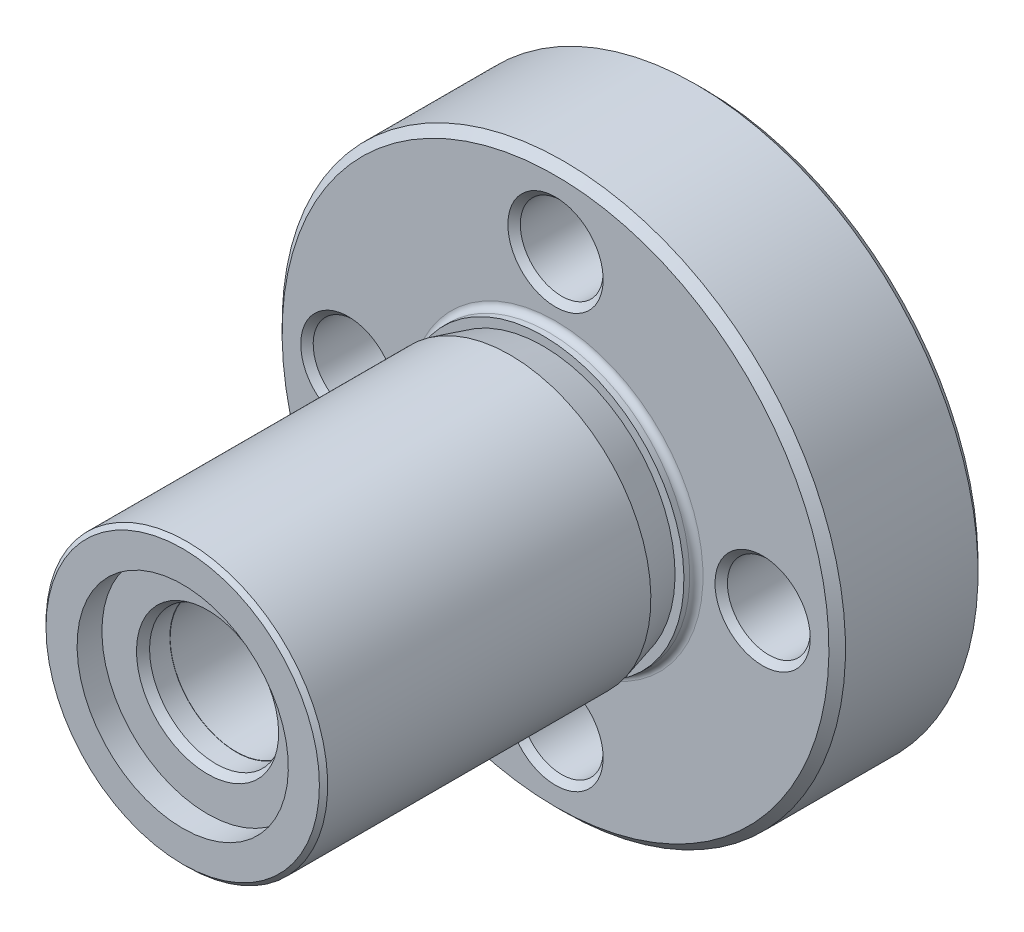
ISO-10303-21;
HEADER;
FILE_DESCRIPTION(('STEP AP214'),'2;1');
FILE_NAME('part.step','',(''),(''),'','','');
FILE_SCHEMA(('AUTOMOTIVE_DESIGN { 1 0 10303 214 1 1 1 1 }'));
ENDSEC;
DATA;
#1=APPLICATION_CONTEXT('core data for automotive mechanical design processes');
#2=APPLICATION_PROTOCOL_DEFINITION('international standard','automotive_design',2000,#1);
#3=PRODUCT_CONTEXT('',#1,'mechanical');
#4=PRODUCT('Part','Part','',(#3));
#5=PRODUCT_RELATED_PRODUCT_CATEGORY('part','',(#4));
#6=PRODUCT_DEFINITION_FORMATION('','',#4);
#7=PRODUCT_DEFINITION_CONTEXT('part definition',#1,'design');
#8=PRODUCT_DEFINITION('design','',#6,#7);
#9=PRODUCT_DEFINITION_SHAPE('','',#8);
#10=(LENGTH_UNIT() NAMED_UNIT(*) SI_UNIT(.MILLI.,.METRE.));
#11=(NAMED_UNIT(*) PLANE_ANGLE_UNIT() SI_UNIT($,.RADIAN.));
#12=(NAMED_UNIT(*) SI_UNIT($,.STERADIAN.) SOLID_ANGLE_UNIT());
#13=UNCERTAINTY_MEASURE_WITH_UNIT(LENGTH_MEASURE(1.E-05),#10,'distance_accuracy_value','');
#14=(GEOMETRIC_REPRESENTATION_CONTEXT(3) GLOBAL_UNCERTAINTY_ASSIGNED_CONTEXT((#13)) GLOBAL_UNIT_ASSIGNED_CONTEXT((#10,
#11,#12)) REPRESENTATION_CONTEXT('',''));
#15=CARTESIAN_POINT('',(0.,0.,0.));
#16=DIRECTION('',(0.,0.,1.));
#17=DIRECTION('',(1.,0.,0.));
#18=AXIS2_PLACEMENT_3D('',#15,#16,#17);
#19=CARTESIAN_POINT('',(0.,0.,0.));
#20=DIRECTION('',(0.,0.,-1.));
#21=DIRECTION('',(0.,1.,0.));
#22=AXIS2_PLACEMENT_3D('',#19,#20,#21);
#23=CYLINDRICAL_SURFACE('',#22,8.);
#24=CARTESIAN_POINT('',(0.,0.,1.));
#25=DIRECTION('',(0.,0.,-1.));
#26=DIRECTION('',(0.,1.,0.));
#27=AXIS2_PLACEMENT_3D('',#24,#25,#26);
#28=CIRCLE('',#27,8.);
#29=CARTESIAN_POINT('',(0.,8.,1.));
#30=VERTEX_POINT('',#29);
#31=EDGE_CURVE('E19',#30,#30,#28,.T.);
#32=ORIENTED_EDGE('',*,*,#31,.T.);
#33=EDGE_LOOP('',(#32));
#34=FACE_BOUND('',#33,.T.);
#35=CARTESIAN_POINT('',(0.,0.,19.5));
#36=DIRECTION('',(0.,0.,1.));
#37=DIRECTION('',(0.,-1.,0.));
#38=AXIS2_PLACEMENT_3D('',#35,#36,#37);
#39=CIRCLE('',#38,8.);
#40=CARTESIAN_POINT('',(0.,-8.,19.5));
#41=VERTEX_POINT('',#40);
#42=EDGE_CURVE('E60',#41,#41,#39,.T.);
#43=ORIENTED_EDGE('',*,*,#42,.T.);
#44=EDGE_LOOP('',(#43));
#45=FACE_BOUND('',#44,.T.);
#46=ADVANCED_FACE('F12',(#34,#45),#23,.F.);
#47=CARTESIAN_POINT('',(0.,0.,0.));
#48=DIRECTION('',(0.,0.,-1.));
#49=DIRECTION('',(0.,1.,0.));
#50=AXIS2_PLACEMENT_3D('',#47,#48,#49);
#51=CYLINDRICAL_SURFACE('',#50,17.);
#52=CARTESIAN_POINT('',(0.,0.,18.8));
#53=DIRECTION('',(0.,0.,1.));
#54=DIRECTION('',(0.,-1.,0.));
#55=AXIS2_PLACEMENT_3D('',#52,#53,#54);
#56=CIRCLE('',#55,17.);
#57=CARTESIAN_POINT('',(0.,-17.,18.8));
#58=VERTEX_POINT('',#57);
#59=EDGE_CURVE('E111',#58,#58,#56,.T.);
#60=ORIENTED_EDGE('',*,*,#59,.T.);
#61=EDGE_LOOP('',(#60));
#62=FACE_BOUND('',#61,.T.);
#63=CARTESIAN_POINT('',(0.,0.,19.5));
#64=DIRECTION('',(0.,0.,-1.));
#65=DIRECTION('',(0.,1.,0.));
#66=AXIS2_PLACEMENT_3D('',#63,#64,#65);
#67=CIRCLE('',#66,17.);
#68=CARTESIAN_POINT('',(0.,17.,19.5));
#69=VERTEX_POINT('',#68);
#70=EDGE_CURVE('E87',#69,#69,#67,.T.);
#71=ORIENTED_EDGE('',*,*,#70,.T.);
#72=EDGE_LOOP('',(#71));
#73=FACE_BOUND('',#72,.T.);
#74=ADVANCED_FACE('F155',(#62,#73),#51,.T.);
#75=CARTESIAN_POINT('',(8.,0.,0.));
#76=DIRECTION('',(0.,0.,-1.));
#77=DIRECTION('',(0.,1.,0.));
#78=AXIS2_PLACEMENT_3D('',#75,#76,#77);
#79=PLANE('',#78);
#80=CARTESIAN_POINT('',(0.,0.,0.));
#81=DIRECTION('',(0.,0.,-1.));
#82=DIRECTION('',(0.,1.,0.));
#83=AXIS2_PLACEMENT_3D('',#80,#81,#82);
#84=CIRCLE('',#83,8.57735026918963);
#85=CARTESIAN_POINT('',(0.,8.57735026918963,0.));
#86=VERTEX_POINT('',#85);
#87=EDGE_CURVE('E8',#86,#86,#84,.F.);
#88=ORIENTED_EDGE('',*,*,#87,.T.);
#89=EDGE_LOOP('',(#88));
#90=FACE_BOUND('',#89,.T.);
#91=CARTESIAN_POINT('',(0.,0.,0.));
#92=DIRECTION('',(0.,0.,-1.));
#93=DIRECTION('',(0.,1.,0.));
#94=AXIS2_PLACEMENT_3D('',#91,#92,#93);
#95=CIRCLE('',#94,33.);
#96=CARTESIAN_POINT('',(0.,33.,0.));
#97=VERTEX_POINT('',#96);
#98=EDGE_CURVE('E99',#97,#97,#95,.T.);
#99=ORIENTED_EDGE('',*,*,#98,.T.);
#100=EDGE_LOOP('',(#99));
#101=FACE_BOUND('',#100,.T.);
#102=CARTESIAN_POINT('',(25.,0.,0.));
#103=DIRECTION('',(0.,0.,-1.));
#104=DIRECTION('',(0.,1.,0.));
#105=AXIS2_PLACEMENT_3D('',#102,#103,#104);
#106=CIRCLE('',#105,5.75);
#107=CARTESIAN_POINT('',(25.,5.75,0.));
#108=VERTEX_POINT('',#107);
#109=EDGE_CURVE('E72',#108,#108,#106,.T.);
#110=ORIENTED_EDGE('',*,*,#109,.F.);
#111=EDGE_LOOP('',(#110));
#112=FACE_BOUND('',#111,.T.);
#113=CARTESIAN_POINT('',(0.,-25.,0.));
#114=DIRECTION('',(0.,0.,-1.));
#115=DIRECTION('',(0.,1.,0.));
#116=AXIS2_PLACEMENT_3D('',#113,#114,#115);
#117=CIRCLE('',#116,5.75);
#118=CARTESIAN_POINT('',(0.,-19.25,0.));
#119=VERTEX_POINT('',#118);
#120=EDGE_CURVE('E75',#119,#119,#117,.T.);
#121=ORIENTED_EDGE('',*,*,#120,.F.);
#122=EDGE_LOOP('',(#121));
#123=FACE_BOUND('',#122,.T.);
#124=CARTESIAN_POINT('',(-25.,0.,0.));
#125=DIRECTION('',(0.,0.,-1.));
#126=DIRECTION('',(0.,1.,0.));
#127=AXIS2_PLACEMENT_3D('',#124,#125,#126);
#128=CIRCLE('',#127,5.75);
#129=CARTESIAN_POINT('',(-25.,5.75,0.));
#130=VERTEX_POINT('',#129);
#131=EDGE_CURVE('E78',#130,#130,#128,.T.);
#132=ORIENTED_EDGE('',*,*,#131,.F.);
#133=EDGE_LOOP('',(#132));
#134=FACE_BOUND('',#133,.T.);
#135=CARTESIAN_POINT('',(0.,25.,0.));
#136=DIRECTION('',(0.,0.,-1.));
#137=DIRECTION('',(0.,1.,0.));
#138=AXIS2_PLACEMENT_3D('',#135,#136,#137);
#139=CIRCLE('',#138,5.75);
#140=CARTESIAN_POINT('',(0.,30.75,0.));
#141=VERTEX_POINT('',#140);
#142=EDGE_CURVE('E81',#141,#141,#139,.T.);
#143=ORIENTED_EDGE('',*,*,#142,.F.);
#144=EDGE_LOOP('',(#143));
#145=FACE_BOUND('',#144,.T.);
#146=ADVANCED_FACE('F162',(#90,#101,#112,#123,#134,#145),#79,.T.);
#147=CARTESIAN_POINT('',(0.,0.,0.));
#148=DIRECTION('',(0.,0.,-1.));
#149=DIRECTION('',(0.,1.,0.));
#150=AXIS2_PLACEMENT_3D('',#147,#148,#149);
#151=CYLINDRICAL_SURFACE('',#150,34.);
#152=CARTESIAN_POINT('',(0.,0.,17.));
#153=DIRECTION('',(0.,0.,1.));
#154=DIRECTION('',(0.,-1.,0.));
#155=AXIS2_PLACEMENT_3D('',#152,#153,#154);
#156=CIRCLE('',#155,34.);
#157=CARTESIAN_POINT('',(0.,-34.,17.));
#158=VERTEX_POINT('',#157);
#159=EDGE_CURVE('E93',#158,#158,#156,.F.);
#160=ORIENTED_EDGE('',*,*,#159,.T.);
#161=EDGE_LOOP('',(#160));
#162=FACE_BOUND('',#161,.T.);
#163=CARTESIAN_POINT('',(0.,0.,1.));
#164=DIRECTION('',(0.,0.,-1.));
#165=DIRECTION('',(0.,1.,0.));
#166=AXIS2_PLACEMENT_3D('',#163,#164,#165);
#167=CIRCLE('',#166,34.);
#168=CARTESIAN_POINT('',(0.,34.,1.));
#169=VERTEX_POINT('',#168);
#170=EDGE_CURVE('E90',#169,#169,#167,.F.);
#171=ORIENTED_EDGE('',*,*,#170,.T.);
#172=EDGE_LOOP('',(#171));
#173=FACE_BOUND('',#172,.T.);
#174=ADVANCED_FACE('F231',(#162,#173),#151,.T.);
#175=CARTESIAN_POINT('',(17.,0.,18.));
#176=DIRECTION('',(0.,0.,1.));
#177=DIRECTION('',(0.,-1.,0.));
#178=AXIS2_PLACEMENT_3D('',#175,#176,#177);
#179=PLANE('',#178);
#180=CARTESIAN_POINT('',(25.,0.,18.));
#181=DIRECTION('',(0.,0.,1.));
#182=DIRECTION('',(0.,-1.,0.));
#183=AXIS2_PLACEMENT_3D('',#180,#181,#182);
#184=CIRCLE('',#183,5.75);
#185=CARTESIAN_POINT('',(25.,-5.75,18.));
#186=VERTEX_POINT('',#185);
#187=EDGE_CURVE('E24',#186,#186,#184,.F.);
#188=ORIENTED_EDGE('',*,*,#187,.T.);
#189=EDGE_LOOP('',(#188));
#190=FACE_BOUND('',#189,.T.);
#191=CARTESIAN_POINT('',(0.,25.,18.));
#192=DIRECTION('',(0.,0.,1.));
#193=DIRECTION('',(0.,-1.,0.));
#194=AXIS2_PLACEMENT_3D('',#191,#192,#193);
#195=CIRCLE('',#194,5.75);
#196=CARTESIAN_POINT('',(0.,19.25,18.));
#197=VERTEX_POINT('',#196);
#198=EDGE_CURVE('E126',#197,#197,#195,.F.);
#199=ORIENTED_EDGE('',*,*,#198,.T.);
#200=EDGE_LOOP('',(#199));
#201=FACE_BOUND('',#200,.T.);
#202=CARTESIAN_POINT('',(-25.,0.,18.));
#203=DIRECTION('',(0.,0.,1.));
#204=DIRECTION('',(0.,-1.,0.));
#205=AXIS2_PLACEMENT_3D('',#202,#203,#204);
#206=CIRCLE('',#205,5.75);
#207=CARTESIAN_POINT('',(-25.,-5.75,18.));
#208=VERTEX_POINT('',#207);
#209=EDGE_CURVE('E123',#208,#208,#206,.F.);
#210=ORIENTED_EDGE('',*,*,#209,.T.);
#211=EDGE_LOOP('',(#210));
#212=FACE_BOUND('',#211,.T.);
#213=CARTESIAN_POINT('',(0.,-25.,18.));
#214=DIRECTION('',(0.,0.,1.));
#215=DIRECTION('',(0.,-1.,0.));
#216=AXIS2_PLACEMENT_3D('',#213,#214,#215);
#217=CIRCLE('',#216,5.75);
#218=CARTESIAN_POINT('',(0.,-30.75,18.));
#219=VERTEX_POINT('',#218);
#220=EDGE_CURVE('E120',#219,#219,#217,.F.);
#221=ORIENTED_EDGE('',*,*,#220,.T.);
#222=EDGE_LOOP('',(#221));
#223=FACE_BOUND('',#222,.T.);
#224=CARTESIAN_POINT('',(0.,0.,18.));
#225=DIRECTION('',(0.,0.,1.));
#226=DIRECTION('',(0.,-1.,0.));
#227=AXIS2_PLACEMENT_3D('',#224,#225,#226);
#228=CIRCLE('',#227,17.8);
#229=CARTESIAN_POINT('',(0.,-17.8,18.));
#230=VERTEX_POINT('',#229);
#231=EDGE_CURVE('E108',#230,#230,#228,.F.);
#232=ORIENTED_EDGE('',*,*,#231,.T.);
#233=EDGE_LOOP('',(#232));
#234=FACE_BOUND('',#233,.T.);
#235=CARTESIAN_POINT('',(0.,0.,18.));
#236=DIRECTION('',(0.,0.,1.));
#237=DIRECTION('',(0.,-1.,0.));
#238=AXIS2_PLACEMENT_3D('',#235,#236,#237);
#239=CIRCLE('',#238,33.);
#240=CARTESIAN_POINT('',(0.,-33.,18.));
#241=VERTEX_POINT('',#240);
#242=EDGE_CURVE('E96',#241,#241,#239,.T.);
#243=ORIENTED_EDGE('',*,*,#242,.T.);
#244=EDGE_LOOP('',(#243));
#245=FACE_BOUND('',#244,.T.);
#246=ADVANCED_FACE('F131',(#190,#201,#212,#223,#234,#245),#179,.T.);
#247=CARTESIAN_POINT('',(-17.,0.,19.5));
#248=DIRECTION('',(0.,0.,1.));
#249=DIRECTION('',(0.,-1.,0.));
#250=AXIS2_PLACEMENT_3D('',#247,#248,#249);
#251=PLANE('',#250);
#252=CARTESIAN_POINT('',(0.,0.,19.5));
#253=DIRECTION('',(0.,0.,-1.));
#254=DIRECTION('',(0.,1.,0.));
#255=AXIS2_PLACEMENT_3D('',#252,#253,#254);
#256=CIRCLE('',#255,15.9282032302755);
#257=CARTESIAN_POINT('',(0.,15.9282032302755,19.5));
#258=VERTEX_POINT('',#257);
#259=EDGE_CURVE('E84',#258,#258,#256,.T.);
#260=ORIENTED_EDGE('',*,*,#259,.T.);
#261=EDGE_LOOP('',(#260));
#262=FACE_BOUND('',#261,.T.);
#263=ORIENTED_EDGE('',*,*,#70,.F.);
#264=EDGE_LOOP('',(#263));
#265=FACE_BOUND('',#264,.T.);
#266=ADVANCED_FACE('F230',(#262,#265),#251,.T.);
#267=CARTESIAN_POINT('',(0.,25.,0.));
#268=DIRECTION('',(0.,0.,-1.));
#269=DIRECTION('',(0.,1.,0.));
#270=AXIS2_PLACEMENT_3D('',#267,#268,#269);
#271=CONICAL_SURFACE('',#270,5.75,0.785398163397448);
#272=CARTESIAN_POINT('',(0.,25.,0.75));
#273=DIRECTION('',(0.,0.,-1.));
#274=DIRECTION('',(0.,1.,0.));
#275=AXIS2_PLACEMENT_3D('',#272,#273,#274);
#276=CIRCLE('',#275,5.);
#277=CARTESIAN_POINT('',(0.,30.,0.75));
#278=VERTEX_POINT('',#277);
#279=EDGE_CURVE('E37',#278,#278,#276,.F.);
#280=ORIENTED_EDGE('',*,*,#279,.T.);
#281=EDGE_LOOP('',(#280));
#282=FACE_BOUND('',#281,.T.);
#283=ORIENTED_EDGE('',*,*,#142,.T.);
#284=EDGE_LOOP('',(#283));
#285=FACE_BOUND('',#284,.T.);
#286=ADVANCED_FACE('F266',(#282,#285),#271,.F.);
#287=CARTESIAN_POINT('',(-25.,0.,0.));
#288=DIRECTION('',(0.,0.,-1.));
#289=DIRECTION('',(0.,1.,0.));
#290=AXIS2_PLACEMENT_3D('',#287,#288,#289);
#291=CONICAL_SURFACE('',#290,5.75,0.785398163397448);
#292=CARTESIAN_POINT('',(-25.,0.,0.75));
#293=DIRECTION('',(0.,0.,-1.));
#294=DIRECTION('',(0.,1.,0.));
#295=AXIS2_PLACEMENT_3D('',#292,#293,#294);
#296=CIRCLE('',#295,5.);
#297=CARTESIAN_POINT('',(-25.,5.,0.75));
#298=VERTEX_POINT('',#297);
#299=EDGE_CURVE('E34',#298,#298,#296,.F.);
#300=ORIENTED_EDGE('',*,*,#299,.T.);
#301=EDGE_LOOP('',(#300));
#302=FACE_BOUND('',#301,.T.);
#303=ORIENTED_EDGE('',*,*,#131,.T.);
#304=EDGE_LOOP('',(#303));
#305=FACE_BOUND('',#304,.T.);
#306=ADVANCED_FACE('F268',(#302,#305),#291,.F.);
#307=CARTESIAN_POINT('',(0.,-25.,0.));
#308=DIRECTION('',(0.,0.,-1.));
#309=DIRECTION('',(0.,1.,0.));
#310=AXIS2_PLACEMENT_3D('',#307,#308,#309);
#311=CONICAL_SURFACE('',#310,5.75,0.785398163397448);
#312=CARTESIAN_POINT('',(0.,-25.,0.75));
#313=DIRECTION('',(0.,0.,-1.));
#314=DIRECTION('',(0.,1.,0.));
#315=AXIS2_PLACEMENT_3D('',#312,#313,#314);
#316=CIRCLE('',#315,5.);
#317=CARTESIAN_POINT('',(0.,-20.,0.75));
#318=VERTEX_POINT('',#317);
#319=EDGE_CURVE('E31',#318,#318,#316,.F.);
#320=ORIENTED_EDGE('',*,*,#319,.T.);
#321=EDGE_LOOP('',(#320));
#322=FACE_BOUND('',#321,.T.);
#323=ORIENTED_EDGE('',*,*,#120,.T.);
#324=EDGE_LOOP('',(#323));
#325=FACE_BOUND('',#324,.T.);
#326=ADVANCED_FACE('F276',(#322,#325),#311,.F.);
#327=CARTESIAN_POINT('',(25.,0.,0.));
#328=DIRECTION('',(0.,0.,-1.));
#329=DIRECTION('',(0.,1.,0.));
#330=AXIS2_PLACEMENT_3D('',#327,#328,#329);
#331=CONICAL_SURFACE('',#330,5.75,0.785398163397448);
#332=CARTESIAN_POINT('',(25.,0.,0.75));
#333=DIRECTION('',(0.,0.,-1.));
#334=DIRECTION('',(0.,1.,0.));
#335=AXIS2_PLACEMENT_3D('',#332,#333,#334);
#336=CIRCLE('',#335,5.);
#337=CARTESIAN_POINT('',(25.,5.,0.75));
#338=VERTEX_POINT('',#337);
#339=EDGE_CURVE('E48',#338,#338,#336,.F.);
#340=ORIENTED_EDGE('',*,*,#339,.T.);
#341=EDGE_LOOP('',(#340));
#342=FACE_BOUND('',#341,.T.);
#343=ORIENTED_EDGE('',*,*,#109,.T.);
#344=EDGE_LOOP('',(#343));
#345=FACE_BOUND('',#344,.T.);
#346=ADVANCED_FACE('F242',(#342,#345),#331,.F.);
#347=CARTESIAN_POINT('',(0.,0.,17.));
#348=DIRECTION('',(0.,0.,-1.));
#349=DIRECTION('',(0.,1.,0.));
#350=AXIS2_PLACEMENT_3D('',#347,#348,#349);
#351=CONICAL_SURFACE('',#350,34.,0.785398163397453);
#352=ORIENTED_EDGE('',*,*,#242,.F.);
#353=EDGE_LOOP('',(#352));
#354=FACE_BOUND('',#353,.T.);
#355=ORIENTED_EDGE('',*,*,#159,.F.);
#356=EDGE_LOOP('',(#355));
#357=FACE_BOUND('',#356,.T.);
#358=ADVANCED_FACE('F239',(#354,#357),#351,.T.);
#359=CARTESIAN_POINT('',(0.,0.,0.));
#360=DIRECTION('',(0.,0.,1.));
#361=DIRECTION('',(0.,-1.,0.));
#362=AXIS2_PLACEMENT_3D('',#359,#360,#361);
#363=CONICAL_SURFACE('',#362,33.,0.785398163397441);
#364=ORIENTED_EDGE('',*,*,#170,.F.);
#365=EDGE_LOOP('',(#364));
#366=FACE_BOUND('',#365,.T.);
#367=ORIENTED_EDGE('',*,*,#98,.F.);
#368=EDGE_LOOP('',(#367));
#369=FACE_BOUND('',#368,.T.);
#370=ADVANCED_FACE('F149',(#366,#369),#363,.T.);
#371=CARTESIAN_POINT('',(0.,0.,18.8));
#372=DIRECTION('',(0.,0.,1.));
#373=DIRECTION('',(0.,-1.,0.));
#374=AXIS2_PLACEMENT_3D('',#371,#372,#373);
#375=TOROIDAL_SURFACE('',#374,17.8,0.8);
#376=ORIENTED_EDGE('',*,*,#59,.F.);
#377=EDGE_LOOP('',(#376));
#378=FACE_BOUND('',#377,.T.);
#379=ORIENTED_EDGE('',*,*,#231,.F.);
#380=EDGE_LOOP('',(#379));
#381=FACE_BOUND('',#380,.T.);
#382=ADVANCED_FACE('F137',(#378,#381),#375,.F.);
#383=CARTESIAN_POINT('',(25.,0.,16.5));
#384=DIRECTION('',(0.,0.,1.));
#385=DIRECTION('',(0.,-1.,0.));
#386=AXIS2_PLACEMENT_3D('',#383,#384,#385);
#387=CONICAL_SURFACE('',#386,4.25,0.78539816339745);
#388=CARTESIAN_POINT('',(25.,0.,17.25));
#389=DIRECTION('',(0.,0.,1.));
#390=DIRECTION('',(0.,-1.,0.));
#391=AXIS2_PLACEMENT_3D('',#388,#389,#390);
#392=CIRCLE('',#391,5.);
#393=CARTESIAN_POINT('',(25.,-5.,17.25));
#394=VERTEX_POINT('',#393);
#395=EDGE_CURVE('E15',#394,#394,#392,.T.);
#396=ORIENTED_EDGE('',*,*,#395,.F.);
#397=EDGE_LOOP('',(#396));
#398=FACE_BOUND('',#397,.T.);
#399=ORIENTED_EDGE('',*,*,#187,.F.);
#400=EDGE_LOOP('',(#399));
#401=FACE_BOUND('',#400,.T.);
#402=ADVANCED_FACE('F134',(#398,#401),#387,.F.);
#403=CARTESIAN_POINT('',(0.,25.,16.5));
#404=DIRECTION('',(0.,0.,1.));
#405=DIRECTION('',(0.,-1.,0.));
#406=AXIS2_PLACEMENT_3D('',#403,#404,#405);
#407=CONICAL_SURFACE('',#406,4.25,0.78539816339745);
#408=CARTESIAN_POINT('',(0.,25.,17.25));
#409=DIRECTION('',(0.,0.,1.));
#410=DIRECTION('',(0.,-1.,0.));
#411=AXIS2_PLACEMENT_3D('',#408,#409,#410);
#412=CIRCLE('',#411,5.);
#413=CARTESIAN_POINT('',(0.,20.,17.25));
#414=VERTEX_POINT('',#413);
#415=EDGE_CURVE('E35',#414,#414,#412,.T.);
#416=ORIENTED_EDGE('',*,*,#415,.F.);
#417=EDGE_LOOP('',(#416));
#418=FACE_BOUND('',#417,.T.);
#419=ORIENTED_EDGE('',*,*,#198,.F.);
#420=EDGE_LOOP('',(#419));
#421=FACE_BOUND('',#420,.T.);
#422=ADVANCED_FACE('F136',(#418,#421),#407,.F.);
#423=CARTESIAN_POINT('',(-25.,0.,16.5));
#424=DIRECTION('',(0.,0.,1.));
#425=DIRECTION('',(0.,-1.,0.));
#426=AXIS2_PLACEMENT_3D('',#423,#424,#425);
#427=CONICAL_SURFACE('',#426,4.25,0.78539816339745);
#428=CARTESIAN_POINT('',(-25.,0.,17.25));
#429=DIRECTION('',(0.,0.,1.));
#430=DIRECTION('',(0.,-1.,0.));
#431=AXIS2_PLACEMENT_3D('',#428,#429,#430);
#432=CIRCLE('',#431,5.);
#433=CARTESIAN_POINT('',(-25.,-5.,17.25));
#434=VERTEX_POINT('',#433);
#435=EDGE_CURVE('E32',#434,#434,#432,.T.);
#436=ORIENTED_EDGE('',*,*,#435,.F.);
#437=EDGE_LOOP('',(#436));
#438=FACE_BOUND('',#437,.T.);
#439=ORIENTED_EDGE('',*,*,#209,.F.);
#440=EDGE_LOOP('',(#439));
#441=FACE_BOUND('',#440,.T.);
#442=ADVANCED_FACE('F146',(#438,#441),#427,.F.);
#443=CARTESIAN_POINT('',(0.,-25.,16.5));
#444=DIRECTION('',(0.,0.,1.));
#445=DIRECTION('',(0.,-1.,0.));
#446=AXIS2_PLACEMENT_3D('',#443,#444,#445);
#447=CONICAL_SURFACE('',#446,4.25,0.78539816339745);
#448=CARTESIAN_POINT('',(0.,-25.,17.25));
#449=DIRECTION('',(0.,0.,1.));
#450=DIRECTION('',(0.,-1.,0.));
#451=AXIS2_PLACEMENT_3D('',#448,#449,#450);
#452=CIRCLE('',#451,5.);
#453=CARTESIAN_POINT('',(0.,-30.,17.25));
#454=VERTEX_POINT('',#453);
#455=EDGE_CURVE('E28',#454,#454,#452,.T.);
#456=ORIENTED_EDGE('',*,*,#455,.F.);
#457=EDGE_LOOP('',(#456));
#458=FACE_BOUND('',#457,.T.);
#459=ORIENTED_EDGE('',*,*,#220,.F.);
#460=EDGE_LOOP('',(#459));
#461=FACE_BOUND('',#460,.T.);
#462=ADVANCED_FACE('F214',(#458,#461),#447,.F.);
#463=CARTESIAN_POINT('',(0.,0.,1.));
#464=DIRECTION('',(0.,0.,-1.));
#465=DIRECTION('',(0.,1.,0.));
#466=AXIS2_PLACEMENT_3D('',#463,#464,#465);
#467=CONICAL_SURFACE('',#466,8.,0.523598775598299);
#468=ORIENTED_EDGE('',*,*,#87,.F.);
#469=EDGE_LOOP('',(#468));
#470=FACE_BOUND('',#469,.T.);
#471=ORIENTED_EDGE('',*,*,#31,.F.);
#472=EDGE_LOOP('',(#471));
#473=FACE_BOUND('',#472,.T.);
#474=ADVANCED_FACE('F207',(#470,#473),#467,.F.);
#475=CARTESIAN_POINT('',(0.,0.,23.4898877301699));
#476=DIRECTION('',(0.,0.,1.));
#477=DIRECTION('',(0.,-1.,0.));
#478=AXIS2_PLACEMENT_3D('',#475,#476,#477);
#479=CONICAL_SURFACE('',#478,17.,0.262432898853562);
#480=ORIENTED_EDGE('',*,*,#259,.F.);
#481=EDGE_LOOP('',(#480));
#482=FACE_BOUND('',#481,.T.);
#483=CARTESIAN_POINT('',(0.,0.,23.4898877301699));
#484=DIRECTION('',(0.,0.,-1.));
#485=DIRECTION('',(0.,1.,0.));
#486=AXIS2_PLACEMENT_3D('',#483,#484,#485);
#487=CIRCLE('',#486,17.);
#488=CARTESIAN_POINT('',(0.,17.,23.4898877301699));
#489=VERTEX_POINT('',#488);
#490=EDGE_CURVE('E57',#489,#489,#487,.T.);
#491=ORIENTED_EDGE('',*,*,#490,.T.);
#492=EDGE_LOOP('',(#491));
#493=FACE_BOUND('',#492,.T.);
#494=ADVANCED_FACE('F200',(#482,#493),#479,.T.);
#495=CARTESIAN_POINT('',(0.,-15.9282032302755,19.5));
#496=DIRECTION('',(0.,0.,1.));
#497=DIRECTION('',(0.,-1.,0.));
#498=AXIS2_PLACEMENT_3D('',#495,#496,#497);
#499=PLANE('',#498);
#500=ORIENTED_EDGE('',*,*,#42,.F.);
#501=EDGE_LOOP('',(#500));
#502=FACE_BOUND('',#501,.T.);
#503=CARTESIAN_POINT('',(0.,0.,19.5));
#504=DIRECTION('',(0.,0.,-1.));
#505=DIRECTION('',(0.,1.,0.));
#506=AXIS2_PLACEMENT_3D('',#503,#504,#505);
#507=CIRCLE('',#506,7.96410161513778);
#508=CARTESIAN_POINT('',(0.,7.96410161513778,19.5));
#509=VERTEX_POINT('',#508);
#510=EDGE_CURVE('E54',#509,#509,#507,.T.);
#511=ORIENTED_EDGE('',*,*,#510,.F.);
#512=EDGE_LOOP('',(#511));
#513=FACE_BOUND('',#512,.T.);
#514=ADVANCED_FACE('F195',(#502,#513),#499,.F.);
#515=CARTESIAN_POINT('',(0.,0.,0.));
#516=DIRECTION('',(0.,0.,-1.));
#517=DIRECTION('',(0.,1.,0.));
#518=AXIS2_PLACEMENT_3D('',#515,#516,#517);
#519=CYLINDRICAL_SURFACE('',#518,7.96410161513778);
#520=CARTESIAN_POINT('',(0.,0.,56.5529288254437));
#521=DIRECTION('',(0.,0.,-1.));
#522=DIRECTION('',(0.,1.,0.));
#523=AXIS2_PLACEMENT_3D('',#520,#521,#522);
#524=CIRCLE('',#523,7.96410161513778);
#525=CARTESIAN_POINT('',(0.,7.96410161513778,56.5529288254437));
#526=VERTEX_POINT('',#525);
#527=EDGE_CURVE('E51',#526,#526,#524,.T.);
#528=ORIENTED_EDGE('',*,*,#527,.F.);
#529=EDGE_LOOP('',(#528));
#530=FACE_BOUND('',#529,.T.);
#531=ORIENTED_EDGE('',*,*,#510,.T.);
#532=EDGE_LOOP('',(#531));
#533=FACE_BOUND('',#532,.T.);
#534=ADVANCED_FACE('F189',(#530,#533),#519,.F.);
#535=CARTESIAN_POINT('',(0.,-7.96410161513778,56.5529288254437));
#536=DIRECTION('',(0.,0.,-1.));
#537=DIRECTION('',(0.,1.,0.));
#538=AXIS2_PLACEMENT_3D('',#535,#536,#537);
#539=PLANE('',#538);
#540=CARTESIAN_POINT('',(0.,0.,56.5529288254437));
#541=DIRECTION('',(0.,0.,-1.));
#542=DIRECTION('',(0.,1.,0.));
#543=AXIS2_PLACEMENT_3D('',#540,#541,#542);
#544=CIRCLE('',#543,8.);
#545=CARTESIAN_POINT('',(0.,8.,56.5529288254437));
#546=VERTEX_POINT('',#545);
#547=EDGE_CURVE('E63',#546,#546,#544,.T.);
#548=ORIENTED_EDGE('',*,*,#547,.F.);
#549=EDGE_LOOP('',(#548));
#550=FACE_BOUND('',#549,.T.);
#551=ORIENTED_EDGE('',*,*,#527,.T.);
#552=EDGE_LOOP('',(#551));
#553=FACE_BOUND('',#552,.T.);
#554=ADVANCED_FACE('F185',(#550,#553),#539,.F.);
#555=CARTESIAN_POINT('',(8.,0.,63.));
#556=DIRECTION('',(0.,0.,1.));
#557=DIRECTION('',(0.,-1.,0.));
#558=AXIS2_PLACEMENT_3D('',#555,#556,#557);
#559=PLANE('',#558);
#560=CARTESIAN_POINT('',(0.,0.,63.));
#561=DIRECTION('',(0.,0.,1.));
#562=DIRECTION('',(0.,-1.,0.));
#563=AXIS2_PLACEMENT_3D('',#560,#561,#562);
#564=CIRCLE('',#563,16.5);
#565=CARTESIAN_POINT('',(0.,-16.5,63.));
#566=VERTEX_POINT('',#565);
#567=EDGE_CURVE('E105',#566,#566,#564,.T.);
#568=ORIENTED_EDGE('',*,*,#567,.T.);
#569=EDGE_LOOP('',(#568));
#570=FACE_BOUND('',#569,.T.);
#571=CARTESIAN_POINT('',(0.,0.,63.));
#572=DIRECTION('',(0.,0.,1.));
#573=DIRECTION('',(0.,-1.,0.));
#574=AXIS2_PLACEMENT_3D('',#571,#572,#573);
#575=CIRCLE('',#574,12.75);
#576=CARTESIAN_POINT('',(0.,-12.75,63.));
#577=VERTEX_POINT('',#576);
#578=EDGE_CURVE('E66',#577,#577,#575,.T.);
#579=ORIENTED_EDGE('',*,*,#578,.F.);
#580=EDGE_LOOP('',(#579));
#581=FACE_BOUND('',#580,.T.);
#582=ADVANCED_FACE('F188',(#570,#581),#559,.T.);
#583=CARTESIAN_POINT('',(0.,0.,62.5));
#584=DIRECTION('',(0.,0.,-1.));
#585=DIRECTION('',(0.,1.,0.));
#586=AXIS2_PLACEMENT_3D('',#583,#584,#585);
#587=CONICAL_SURFACE('',#586,17.,0.785398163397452);
#588=ORIENTED_EDGE('',*,*,#567,.F.);
#589=EDGE_LOOP('',(#588));
#590=FACE_BOUND('',#589,.T.);
#591=CARTESIAN_POINT('',(0.,0.,62.5));
#592=DIRECTION('',(0.,0.,1.));
#593=DIRECTION('',(0.,-1.,0.));
#594=AXIS2_PLACEMENT_3D('',#591,#592,#593);
#595=CIRCLE('',#594,17.);
#596=CARTESIAN_POINT('',(0.,-17.,62.5));
#597=VERTEX_POINT('',#596);
#598=EDGE_CURVE('E102',#597,#597,#595,.F.);
#599=ORIENTED_EDGE('',*,*,#598,.F.);
#600=EDGE_LOOP('',(#599));
#601=FACE_BOUND('',#600,.T.);
#602=ADVANCED_FACE('F283',(#590,#601),#587,.T.);
#603=ORIENTED_EDGE('',*,*,#490,.F.);
#604=EDGE_LOOP('',(#603));
#605=FACE_BOUND('',#604,.T.);
#606=ORIENTED_EDGE('',*,*,#598,.T.);
#607=EDGE_LOOP('',(#606));
#608=FACE_BOUND('',#607,.T.);
#609=ADVANCED_FACE('F165',(#605,#608),#51,.T.);
#610=CARTESIAN_POINT('',(0.,0.,60.));
#611=DIRECTION('',(0.,0.,1.));
#612=DIRECTION('',(0.,-1.,0.));
#613=AXIS2_PLACEMENT_3D('',#610,#611,#612);
#614=CYLINDRICAL_SURFACE('',#613,12.75);
#615=CARTESIAN_POINT('',(0.,0.,60.));
#616=DIRECTION('',(0.,0.,1.));
#617=DIRECTION('',(0.,-1.,0.));
#618=AXIS2_PLACEMENT_3D('',#615,#616,#617);
#619=CIRCLE('',#618,12.75);
#620=CARTESIAN_POINT('',(0.,-12.75,60.));
#621=VERTEX_POINT('',#620);
#622=EDGE_CURVE('E69',#621,#621,#619,.T.);
#623=ORIENTED_EDGE('',*,*,#622,.F.);
#624=EDGE_LOOP('',(#623));
#625=FACE_BOUND('',#624,.T.);
#626=ORIENTED_EDGE('',*,*,#578,.T.);
#627=EDGE_LOOP('',(#626));
#628=FACE_BOUND('',#627,.T.);
#629=ADVANCED_FACE('F295',(#625,#628),#614,.F.);
#630=CARTESIAN_POINT('',(0.,0.,60.));
#631=DIRECTION('',(0.,0.,1.));
#632=DIRECTION('',(0.,-1.,0.));
#633=AXIS2_PLACEMENT_3D('',#630,#631,#632);
#634=PLANE('',#633);
#635=CARTESIAN_POINT('',(0.,0.,60.));
#636=DIRECTION('',(0.,0.,1.));
#637=DIRECTION('',(0.,-1.,0.));
#638=AXIS2_PLACEMENT_3D('',#635,#636,#637);
#639=CIRCLE('',#638,8.57735026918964);
#640=CARTESIAN_POINT('',(0.,-8.57735026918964,60.));
#641=VERTEX_POINT('',#640);
#642=EDGE_CURVE('E117',#641,#641,#639,.F.);
#643=ORIENTED_EDGE('',*,*,#642,.T.);
#644=EDGE_LOOP('',(#643));
#645=FACE_BOUND('',#644,.T.);
#646=ORIENTED_EDGE('',*,*,#622,.T.);
#647=EDGE_LOOP('',(#646));
#648=FACE_BOUND('',#647,.T.);
#649=ADVANCED_FACE('F179',(#645,#648),#634,.T.);
#650=CARTESIAN_POINT('',(0.,0.,59.));
#651=DIRECTION('',(0.,0.,1.));
#652=DIRECTION('',(0.,-1.,0.));
#653=AXIS2_PLACEMENT_3D('',#650,#651,#652);
#654=CONICAL_SURFACE('',#653,8.,0.523598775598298);
#655=ORIENTED_EDGE('',*,*,#642,.F.);
#656=EDGE_LOOP('',(#655));
#657=FACE_BOUND('',#656,.T.);
#658=CARTESIAN_POINT('',(0.,0.,59.));
#659=DIRECTION('',(0.,0.,1.));
#660=DIRECTION('',(0.,-1.,0.));
#661=AXIS2_PLACEMENT_3D('',#658,#659,#660);
#662=CIRCLE('',#661,8.);
#663=CARTESIAN_POINT('',(0.,-8.,59.));
#664=VERTEX_POINT('',#663);
#665=EDGE_CURVE('E114',#664,#664,#662,.T.);
#666=ORIENTED_EDGE('',*,*,#665,.F.);
#667=EDGE_LOOP('',(#666));
#668=FACE_BOUND('',#667,.T.);
#669=ADVANCED_FACE('F169',(#657,#668),#654,.F.);
#670=ORIENTED_EDGE('',*,*,#665,.T.);
#671=EDGE_LOOP('',(#670));
#672=FACE_BOUND('',#671,.T.);
#673=ORIENTED_EDGE('',*,*,#547,.T.);
#674=EDGE_LOOP('',(#673));
#675=FACE_BOUND('',#674,.T.);
#676=ADVANCED_FACE('F157',(#672,#675),#23,.F.);
#677=CARTESIAN_POINT('',(0.,-25.,0.));
#678=DIRECTION('',(0.,0.,1.));
#679=DIRECTION('',(0.,-1.,0.));
#680=AXIS2_PLACEMENT_3D('',#677,#678,#679);
#681=CYLINDRICAL_SURFACE('',#680,5.);
#682=ORIENTED_EDGE('',*,*,#455,.T.);
#683=EDGE_LOOP('',(#682));
#684=FACE_BOUND('',#683,.T.);
#685=ORIENTED_EDGE('',*,*,#319,.F.);
#686=EDGE_LOOP('',(#685));
#687=FACE_BOUND('',#686,.T.);
#688=ADVANCED_FACE('F168',(#684,#687),#681,.F.);
#689=CARTESIAN_POINT('',(-25.,0.,0.));
#690=DIRECTION('',(0.,0.,1.));
#691=DIRECTION('',(0.,-1.,0.));
#692=AXIS2_PLACEMENT_3D('',#689,#690,#691);
#693=CYLINDRICAL_SURFACE('',#692,5.);
#694=ORIENTED_EDGE('',*,*,#435,.T.);
#695=EDGE_LOOP('',(#694));
#696=FACE_BOUND('',#695,.T.);
#697=ORIENTED_EDGE('',*,*,#299,.F.);
#698=EDGE_LOOP('',(#697));
#699=FACE_BOUND('',#698,.T.);
#700=ADVANCED_FACE('F176',(#696,#699),#693,.F.);
#701=CARTESIAN_POINT('',(0.,25.,0.));
#702=DIRECTION('',(0.,0.,1.));
#703=DIRECTION('',(0.,-1.,0.));
#704=AXIS2_PLACEMENT_3D('',#701,#702,#703);
#705=CYLINDRICAL_SURFACE('',#704,5.);
#706=ORIENTED_EDGE('',*,*,#415,.T.);
#707=EDGE_LOOP('',(#706));
#708=FACE_BOUND('',#707,.T.);
#709=ORIENTED_EDGE('',*,*,#279,.F.);
#710=EDGE_LOOP('',(#709));
#711=FACE_BOUND('',#710,.T.);
#712=ADVANCED_FACE('F484',(#708,#711),#705,.F.);
#713=CARTESIAN_POINT('',(25.,0.,0.));
#714=DIRECTION('',(0.,0.,1.));
#715=DIRECTION('',(0.,-1.,0.));
#716=AXIS2_PLACEMENT_3D('',#713,#714,#715);
#717=CYLINDRICAL_SURFACE('',#716,5.);
#718=ORIENTED_EDGE('',*,*,#395,.T.);
#719=EDGE_LOOP('',(#718));
#720=FACE_BOUND('',#719,.T.);
#721=ORIENTED_EDGE('',*,*,#339,.F.);
#722=EDGE_LOOP('',(#721));
#723=FACE_BOUND('',#722,.T.);
#724=ADVANCED_FACE('F492',(#720,#723),#717,.F.);
#725=CLOSED_SHELL('',(#46,#74,#146,#174,#246,#266,#286,#306,#326,#346,#358,#370,#382,#402,#422,
#442,#462,#474,#494,#514,#534,#554,#582,#602,#609,#629,#649,#669,#676,#688,#700,#712,#724));
#726=MANIFOLD_SOLID_BREP('B1',#725);
#727=ADVANCED_BREP_SHAPE_REPRESENTATION('',(#18,#726),#14);
#728=SHAPE_DEFINITION_REPRESENTATION(#9,#727);
ENDSEC;
END-ISO-10303-21;
